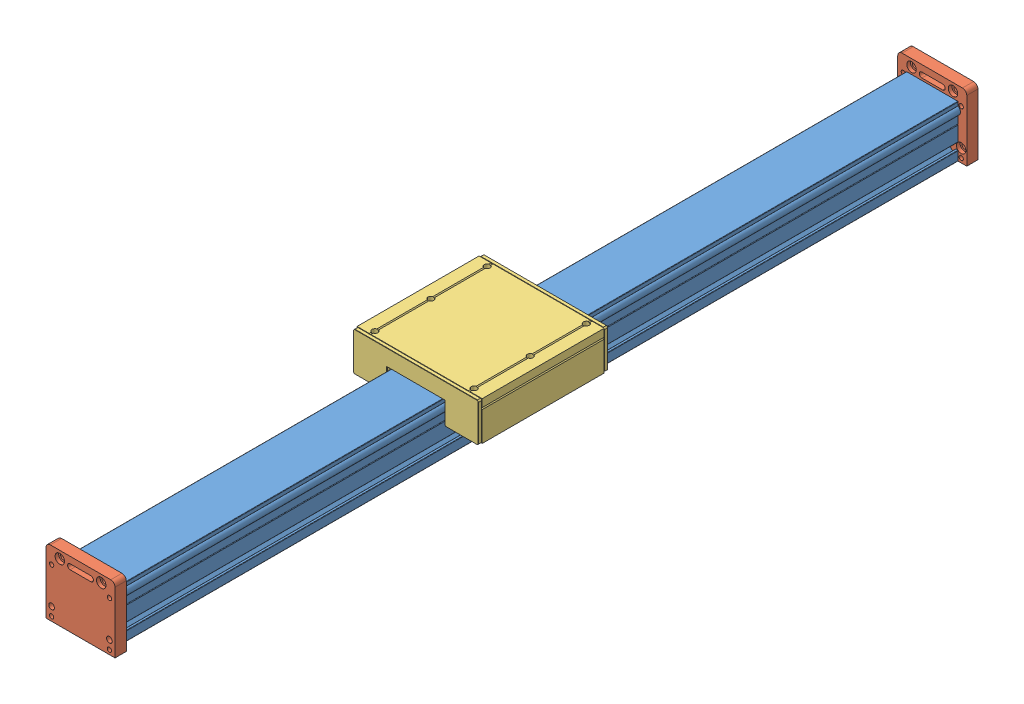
SolidWorks assembly MO_060_150_1000.SLDASM, configuration Standard (file format 3800). Lengths in mm.
Overall size (145 80 1000).
4 component instances, 3 part files, 11 mates.
Components (placement in the parent):
- Profil_MZ060-1: Profil_MZ060.SLDPRT [l=974] at (0 30 0) x (-1 0 0) z (0 0 1) size (65.5 60 974)
- Adapterplatte_MZS060-1: Adapterplatte_MZS060.SLDPRT [Standard] at (0 0 974) size (80 76 13)
- Adapterplatte_MZS060-2: Adapterplatte_MZS060.SLDPRT [Standard] x (-1 0 0) z (0 0 -1) size (80 76 13)
- Schlitten_MO_060_150-1: Schlitten_MO_060_150.SLDPRT [Standard] at (0 0 523.3445) size (145 45 150)
Mates (geometry in assembly coordinates):
- Deckungsgleich1: coincident aligned: plane of Profil_MZ060-1 through (0 30 0) normal (0 0 1)
- Deckungsgleich2: coincident anti-aligned: unknown of Profil_MZ060-1
- Deckungsgleich3: coincident anti-aligned: unknown of Profil_MZ060-1
- Deckungsgleich4: coincident anti-aligned: plane of Adapterplatte_MZS060-2 through (40 0 0) normal (0 0 1); plane of Profil_MZ060-1 through (-30 60 0) normal (0 0 -1)
- Deckungsgleich5: coincident aligned: plane of Profil_MZ060-1 through (-30 0 974) normal (0 -1 0); plane of Adapterplatte_MZS060-2 through (40 0 -13) normal (0 -1 0)
- Breite1: width: plane of Adapterplatte_MZS060-2 through (-40 0 -13) normal (-1 0 0); plane of Adapterplatte_MZS060-2 through (40 0 -13) normal (1 0 0); plane of Profil_MZ060-1 through (-30 60 974) normal (-1 0 0); plane of Profil_MZ060-1 through (30 0 974) normal (1 0 0)
- Deckungsgleich6: coincident anti-aligned: plane of Profil_MZ060-1 through (-30 60 974) normal (0 0 1); plane of Adapterplatte_MZS060-1 through (-40 0 974) normal (0 0 -1)
- Deckungsgleich7: coincident aligned: plane of Profil_MZ060-1 through (-30 0 974) normal (0 -1 0); plane of Adapterplatte_MZS060-1 through (-40 0 987) normal (0 -1 0)
- Breite2: width: plane of Adapterplatte_MZS060-1 through (-40 0 987) normal (-1 0 0); plane of Adapterplatte_MZS060-1 through (40 0 987) normal (1 0 0); plane of Profil_MZ060-1 through (30 0 974) normal (1 0 0); plane of Profil_MZ060-1 through (-30 60 974) normal (-1 0 0)
- Abstand1: distance = 80 mm: plane of Profil_MZ060-1 through (-30 0 974) normal (0 -1 0); plane of Schlitten_MO_060_150-1 through (72.5 80 594.3445) normal (0 1 0)
- Breite3: width: plane of Schlitten_MO_060_150-1 through (-72.5 80 594.3445) normal (-1 0 0); plane of Schlitten_MO_060_150-1 through (72.5 80 594.3445) normal (1 0 0); plane of Profil_MZ060-1 through (30 0 974) normal (1 0 0); plane of Profil_MZ060-1 through (-30 60 974) normal (-1 0 0)
